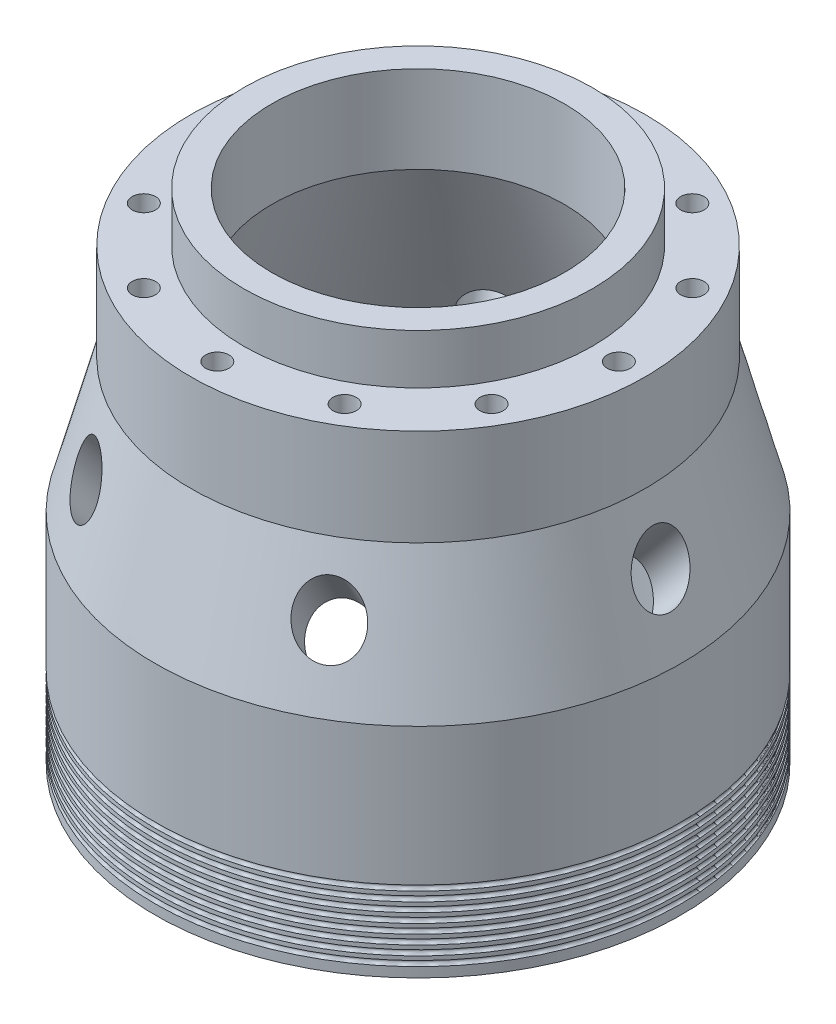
from build123d import *

# Parameters (mm, degrees)
CIRPATTERN1_COUNT = 12
CIRPATTERN2_COUNT = 6
SKETCH5_R         = 4.25
LPATTERN1_COUNT   = 8
LPATTERN1_PITCH   = 15


with BuildPart() as part:
    # Sketch1 → Revolve1 (revolve)
    with BuildSketch(Plane(origin=(0, 0, 0), x_dir=(0, 0, -1), z_dir=(1, 0, 0))):
        Polygon((422.5, 0), (422.5, 350), (365, 564.592921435), (365, 720), (280, 720), (280, 800), (235, 800), (235, 660), (380, 261.615774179), (380, 0), align=None)
    revolve(axis=Axis((0, 0, 0), (0, 1, 0)))

    # Sketch3 → M42 Tapped Hole1 (revolve, cut)
    with BuildSketch(Plane(origin=(0, 720, -322.5), x_dir=(0, 0, 1), z_dir=(1, 0, 0))):
        Polygon((0, 0), (0, 108.766136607), (18.75, 97.5), (18.75, 0), align=None)
    m42_tapped_hole1 = revolve(axis=Axis((0, 726.35, -322.5), (0, -1, 0)), mode=Mode.SUBTRACT)

    # CirPattern1: M42 Tapped Hole1 ×12 about axis
    cirpattern1_axis = Axis((0, 0, 0), (0, 1, 0))
    for i in range(1, CIRPATTERN1_COUNT):
        add(m42_tapped_hole1.rotate(cirpattern1_axis, i * 360 / CIRPATTERN1_COUNT), mode=Mode.SUBTRACT)

    # Sketch4 → Cut-Revolve1 (revolve, cut)
    with BuildSketch(Plane.XY, mode=Mode.PRIVATE) as cut_revolve1_sk:
        Polygon((-417.033195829, 497.00080936), (-314.749653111, 375.104029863), (-349.221653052, 346.178587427), (-451.505195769, 468.075366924), align=None)
    cut_revolve1 = revolve(cut_revolve1_sk.sketch.rotate(Axis((0, 0, 0), (-0.6427876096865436, 0.7660444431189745, 0)), 305.025094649), axis=Axis((0, 0, 0), (-0.6427876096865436, 0.7660444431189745, 0)), mode=Mode.SUBTRACT)

    # CirPattern2: Cut-Revolve1 ×6 about axis
    cirpattern2_axis = Axis((0, 0, 0), (0, -1, 0))
    for i in range(1, CIRPATTERN2_COUNT):
        add(cut_revolve1.rotate(cirpattern2_axis, i * 360 / CIRPATTERN2_COUNT), mode=Mode.SUBTRACT)

    # Sketch5 → Cut-Revolve2 (revolve, cut)
    with BuildSketch(Plane.XY, mode=Mode.PRIVATE) as cut_revolve2_sk:
        with Locations((-422.5, 20)):
            Circle(SKETCH5_R)
    cut_revolve2 = revolve(cut_revolve2_sk.sketch.rotate(Axis((0, 0, 0), (0, 1, 0)), 270), axis=Axis((0, 0, 0), (0, 1, 0)), mode=Mode.SUBTRACT)

    # LPattern1: Cut-Revolve2 ×8
    with Locations(*[(0, i * LPATTERN1_PITCH, 0) for i in range(1, LPATTERN1_COUNT)]):
        add(cut_revolve2, mode=Mode.SUBTRACT)


solid = part.part
